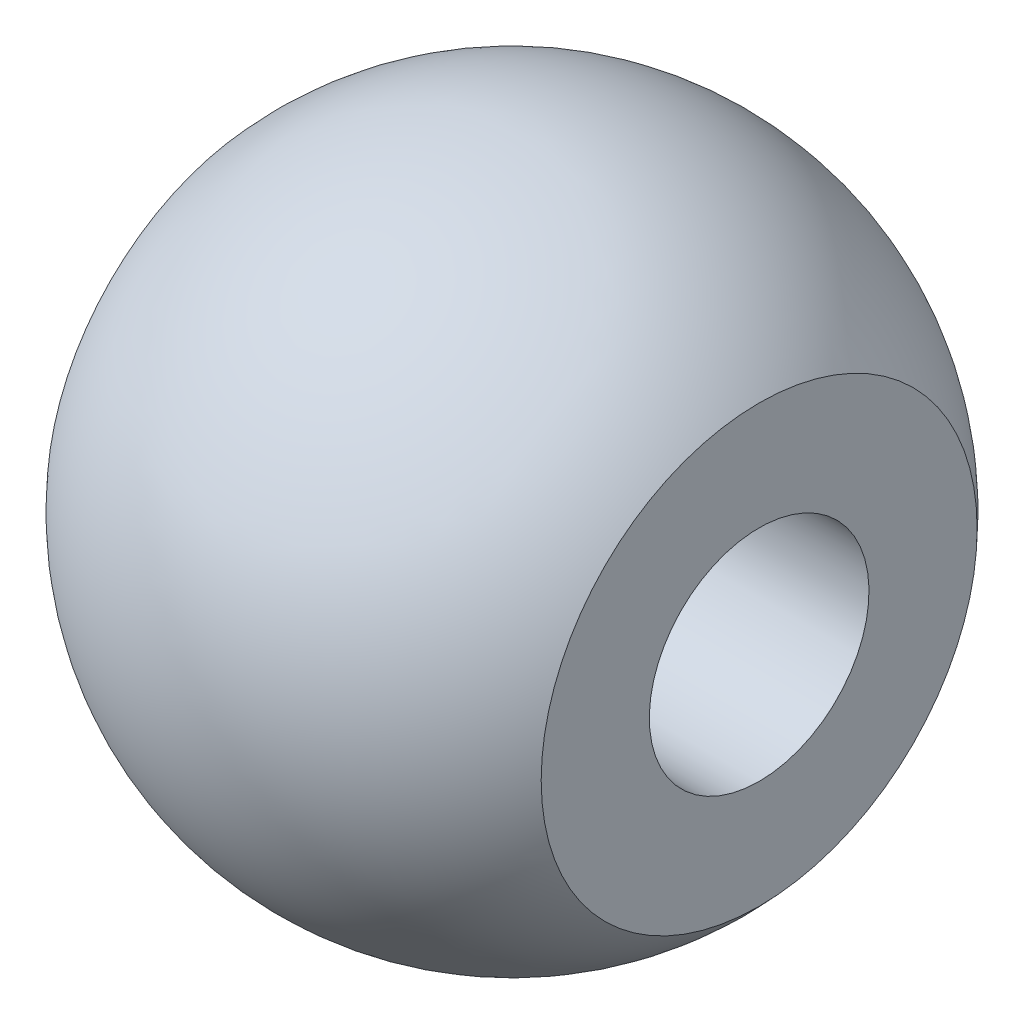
ISO-10303-21;
HEADER;
FILE_DESCRIPTION(('STEP AP214'),'2;1');
FILE_NAME('part.step','',(''),(''),'','','');
FILE_SCHEMA(('AUTOMOTIVE_DESIGN { 1 0 10303 214 1 1 1 1 }'));
ENDSEC;
DATA;
#1=APPLICATION_CONTEXT('core data for automotive mechanical design processes');
#2=APPLICATION_PROTOCOL_DEFINITION('international standard','automotive_design',2000,#1);
#3=PRODUCT_CONTEXT('',#1,'mechanical');
#4=PRODUCT('Part','Part','',(#3));
#5=PRODUCT_RELATED_PRODUCT_CATEGORY('part','',(#4));
#6=PRODUCT_DEFINITION_FORMATION('','',#4);
#7=PRODUCT_DEFINITION_CONTEXT('part definition',#1,'design');
#8=PRODUCT_DEFINITION('design','',#6,#7);
#9=PRODUCT_DEFINITION_SHAPE('','',#8);
#10=(LENGTH_UNIT() NAMED_UNIT(*) SI_UNIT(.MILLI.,.METRE.));
#11=(NAMED_UNIT(*) PLANE_ANGLE_UNIT() SI_UNIT($,.RADIAN.));
#12=(NAMED_UNIT(*) SI_UNIT($,.STERADIAN.) SOLID_ANGLE_UNIT());
#13=UNCERTAINTY_MEASURE_WITH_UNIT(LENGTH_MEASURE(1.E-05),#10,'distance_accuracy_value','');
#14=(GEOMETRIC_REPRESENTATION_CONTEXT(3) GLOBAL_UNCERTAINTY_ASSIGNED_CONTEXT((#13)) GLOBAL_UNIT_ASSIGNED_CONTEXT((#10,
#11,#12)) REPRESENTATION_CONTEXT('',''));
#15=CARTESIAN_POINT('',(0.,0.,0.));
#16=DIRECTION('',(0.,0.,1.));
#17=DIRECTION('',(1.,0.,0.));
#18=AXIS2_PLACEMENT_3D('',#15,#16,#17);
#19=CARTESIAN_POINT('',(0.,0.,0.));
#20=DIRECTION('',(-1.,0.,0.));
#21=DIRECTION('',(0.,1.,0.));
#22=AXIS2_PLACEMENT_3D('',#19,#20,#21);
#23=SPHERICAL_SURFACE('',#22,6.);
#24=CARTESIAN_POINT('',(-4.5,0.,0.));
#25=DIRECTION('',(-1.,0.,0.));
#26=DIRECTION('',(0.,-1.,0.));
#27=AXIS2_PLACEMENT_3D('',#24,#25,#26);
#28=CIRCLE('',#27,3.96862696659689);
#29=CARTESIAN_POINT('',(-4.5,3.96862696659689,0.));
#30=VERTEX_POINT('',#29);
#31=EDGE_CURVE('E10',#30,#30,#28,.T.);
#32=CARTESIAN_POINT('',(4.5,0.,0.));
#33=DIRECTION('',(-1.,0.,0.));
#34=DIRECTION('',(0.,-1.,0.));
#35=AXIS2_PLACEMENT_3D('',#32,#33,#34);
#36=CIRCLE('',#35,3.96862696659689);
#37=CARTESIAN_POINT('',(4.5,3.96862696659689,0.));
#38=VERTEX_POINT('',#37);
#39=EDGE_CURVE('E44',#38,#38,#36,.T.);
#40=CARTESIAN_POINT('',(-4.5,3.96862696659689,0.));
#41=CARTESIAN_POINT('',(-4.42988448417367,4.04813476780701,0.));
#42=CARTESIAN_POINT('',(-4.35765791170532,4.12578044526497,0.));
#43=CARTESIAN_POINT('',(-4.20919440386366,4.27713817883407,0.));
#44=CARTESIAN_POINT('',(-4.13295746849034,4.35085023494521,0.));
#45=CARTESIAN_POINT('',(-3.97668498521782,4.4941313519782,0.));
#46=CARTESIAN_POINT('',(-3.89664943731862,4.56370041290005,0.));
#47=CARTESIAN_POINT('',(-3.73300516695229,4.69850076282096,0.));
#48=CARTESIAN_POINT('',(-3.64939644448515,4.76373205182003,0.));
#49=CARTESIAN_POINT('',(-3.47884049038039,4.8896734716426,0.));
#50=CARTESIAN_POINT('',(-3.39189325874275,4.9503836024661,0.));
#51=CARTESIAN_POINT('',(-3.21490454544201,5.06711223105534,0.));
#52=CARTESIAN_POINT('',(-3.1248630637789,5.12313072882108,0.));
#53=CARTESIAN_POINT('',(-2.94193874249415,5.23031873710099,0.));
#54=CARTESIAN_POINT('',(-2.84905590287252,5.28148824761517,0.));
#55=CARTESIAN_POINT('',(-2.66070975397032,5.37883456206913,0.));
#56=CARTESIAN_POINT('',(-2.56524644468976,5.42501136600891,0.));
#57=CARTESIAN_POINT('',(-2.37200748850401,5.51224256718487,0.));
#58=CARTESIAN_POINT('',(-2.27423184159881,5.55329696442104,0.));
#59=CARTESIAN_POINT('',(-2.07664283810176,5.63016804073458,0.));
#60=CARTESIAN_POINT('',(-1.9768294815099,5.66598471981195,0.));
#61=CARTESIAN_POINT('',(-1.77544540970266,5.73227975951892,0.));
#62=CARTESIAN_POINT('',(-1.67387469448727,5.76275812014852,0.));
#63=CARTESIAN_POINT('',(-1.46926119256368,5.81829091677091,0.));
#64=CARTESIAN_POINT('',(-1.36621840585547,5.8433453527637,0.));
#65=CARTESIAN_POINT('',(-1.15895018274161,5.8879599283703,0.));
#66=CARTESIAN_POINT('',(-1.05472474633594,5.90752006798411,0.));
#67=CARTESIAN_POINT('',(-0.845383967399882,5.94109111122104,0.));
#68=CARTESIAN_POINT('',(-0.740268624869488,5.95510201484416,0.));
#69=CARTESIAN_POINT('',(-0.529443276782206,5.97753523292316,0.));
#70=CARTESIAN_POINT('',(-0.423733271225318,5.98595754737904,0.));
#71=CARTESIAN_POINT('',(-0.21201551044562,5.99718993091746,0.));
#72=CARTESIAN_POINT('',(-0.10600775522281,6.,0.));
#73=CARTESIAN_POINT('',(0.106007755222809,6.,0.));
#74=CARTESIAN_POINT('',(0.212015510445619,5.99718993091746,0.));
#75=CARTESIAN_POINT('',(0.423733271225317,5.98595754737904,0.));
#76=CARTESIAN_POINT('',(0.529443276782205,5.97753523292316,0.));
#77=CARTESIAN_POINT('',(0.740268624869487,5.95510201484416,0.));
#78=CARTESIAN_POINT('',(0.845383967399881,5.94109111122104,0.));
#79=CARTESIAN_POINT('',(1.05472474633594,5.90752006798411,0.));
#80=CARTESIAN_POINT('',(1.15895018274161,5.8879599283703,0.));
#81=CARTESIAN_POINT('',(1.36621840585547,5.8433453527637,0.));
#82=CARTESIAN_POINT('',(1.46926119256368,5.81829091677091,0.));
#83=CARTESIAN_POINT('',(1.67387469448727,5.76275812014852,0.));
#84=CARTESIAN_POINT('',(1.77544540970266,5.73227975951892,0.));
#85=CARTESIAN_POINT('',(1.9768294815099,5.66598471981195,0.));
#86=CARTESIAN_POINT('',(2.07664283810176,5.63016804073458,0.));
#87=CARTESIAN_POINT('',(2.27423184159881,5.55329696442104,0.));
#88=CARTESIAN_POINT('',(2.37200748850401,5.51224256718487,0.));
#89=CARTESIAN_POINT('',(2.56524644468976,5.42501136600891,0.));
#90=CARTESIAN_POINT('',(2.66070975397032,5.37883456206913,0.));
#91=CARTESIAN_POINT('',(2.84905590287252,5.28148824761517,0.));
#92=CARTESIAN_POINT('',(2.94193874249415,5.23031873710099,0.));
#93=CARTESIAN_POINT('',(3.1248630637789,5.12313072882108,0.));
#94=CARTESIAN_POINT('',(3.21490454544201,5.06711223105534,0.));
#95=CARTESIAN_POINT('',(3.39189325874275,4.9503836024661,0.));
#96=CARTESIAN_POINT('',(3.47884049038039,4.8896734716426,0.));
#97=CARTESIAN_POINT('',(3.64939644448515,4.76373205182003,0.));
#98=CARTESIAN_POINT('',(3.73300516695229,4.69850076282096,0.));
#99=CARTESIAN_POINT('',(3.89664943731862,4.56370041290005,0.));
#100=CARTESIAN_POINT('',(3.97668498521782,4.4941313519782,0.));
#101=CARTESIAN_POINT('',(4.13295746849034,4.35085023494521,0.));
#102=CARTESIAN_POINT('',(4.20919440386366,4.27713817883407,0.));
#103=CARTESIAN_POINT('',(4.35765791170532,4.12578044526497,0.));
#104=CARTESIAN_POINT('',(4.42988448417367,4.04813476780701,0.));
#105=CARTESIAN_POINT('',(4.5,3.96862696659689,0.));
#106=B_SPLINE_CURVE_WITH_KNOTS('',3,(#40,#41,#42,#43,#44,#45,#46,#47,#48,#49,#50,#51,#52,#53,
#54,#55,#56,#57,#58,#59,#60,#61,#62,#63,#64,#65,#66,#67,#68,#69,#70,#71,#72,#73,#74,#75,#76,#77,
#78,#79,#80,#81,#82,#83,#84,#85,#86,#87,#88,#89,#90,#91,#92,#93,#94,#95,#96,#97,#98,#99,#100,
#101,#102,#103,#104,#105),.UNSPECIFIED.,.F.,.F.,(4,2,2,2,2,2,2,2,2,2,2,2,2,2,2,2,2,2,2,2,2,2,2,
2,2,2,2,2,2,2,2,2,4),(0.,0.317986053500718,0.635972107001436,0.953958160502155,1.27194421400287,
1.58993026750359,1.90791632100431,2.22590237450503,2.54388842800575,2.86187448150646,
3.17986053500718,3.4978465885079,3.81583264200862,4.13381869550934,4.45180474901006,
4.76979080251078,5.08777685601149,5.40576290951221,5.72374896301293,6.04173501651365,
6.35972107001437,6.67770712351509,6.9956931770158,7.31367923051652,7.63166528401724,
7.94965133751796,8.26763739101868,8.5856234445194,8.90360949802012,9.22159555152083,
9.53958160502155,9.85756765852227,10.175553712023),.UNSPECIFIED.);
#107=EDGE_CURVE('BSEAM30',#30,#38,#106,.T.);
#108=ORIENTED_EDGE('',*,*,#31,.F.);
#109=ORIENTED_EDGE('',*,*,#39,.T.);
#110=ORIENTED_EDGE('',*,*,#107,.T.);
#111=ORIENTED_EDGE('',*,*,#107,.F.);
#112=EDGE_LOOP('',(#108,#110,#109,#111));
#113=FACE_BOUND('',#112,.T.);
#114=ADVANCED_FACE('F30',(#113),#23,.T.);
#115=CARTESIAN_POINT('',(-4.5,0.,0.));
#116=DIRECTION('',(-1.,0.,0.));
#117=DIRECTION('',(0.,-1.,0.));
#118=AXIS2_PLACEMENT_3D('',#115,#116,#117);
#119=CONICAL_SURFACE('',#118,3.96862696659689,1.10079445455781);
#120=CARTESIAN_POINT('',(-3.5,0.,0.));
#121=DIRECTION('',(-1.,0.,0.));
#122=DIRECTION('',(0.,-1.,0.));
#123=AXIS2_PLACEMENT_3D('',#120,#121,#122);
#124=CIRCLE('',#123,2.);
#125=CARTESIAN_POINT('',(-3.5,-2.,0.));
#126=VERTEX_POINT('',#125);
#127=EDGE_CURVE('E36',#126,#126,#124,.T.);
#128=ORIENTED_EDGE('',*,*,#127,.F.);
#129=EDGE_LOOP('',(#128));
#130=FACE_BOUND('',#129,.T.);
#131=ORIENTED_EDGE('',*,*,#31,.T.);
#132=EDGE_LOOP('',(#131));
#133=FACE_BOUND('',#132,.T.);
#134=ADVANCED_FACE('F59',(#130,#133),#119,.F.);
#135=CARTESIAN_POINT('',(-4.5,0.,0.));
#136=DIRECTION('',(-1.,0.,0.));
#137=DIRECTION('',(0.,-1.,0.));
#138=AXIS2_PLACEMENT_3D('',#135,#136,#137);
#139=CYLINDRICAL_SURFACE('',#138,2.);
#140=CARTESIAN_POINT('',(4.5,0.,0.));
#141=DIRECTION('',(-1.,0.,0.));
#142=DIRECTION('',(0.,-1.,0.));
#143=AXIS2_PLACEMENT_3D('',#140,#141,#142);
#144=CIRCLE('',#143,2.);
#145=CARTESIAN_POINT('',(4.5,-2.,0.));
#146=VERTEX_POINT('',#145);
#147=EDGE_CURVE('E40',#146,#146,#144,.T.);
#148=ORIENTED_EDGE('',*,*,#147,.F.);
#149=EDGE_LOOP('',(#148));
#150=FACE_BOUND('',#149,.T.);
#151=ORIENTED_EDGE('',*,*,#127,.T.);
#152=EDGE_LOOP('',(#151));
#153=FACE_BOUND('',#152,.T.);
#154=ADVANCED_FACE('F54',(#150,#153),#139,.F.);
#155=CARTESIAN_POINT('',(4.5,2.,0.));
#156=DIRECTION('',(-1.,0.,0.));
#157=DIRECTION('',(0.,-1.,0.));
#158=AXIS2_PLACEMENT_3D('',#155,#156,#157);
#159=PLANE('',#158);
#160=ORIENTED_EDGE('',*,*,#39,.F.);
#161=EDGE_LOOP('',(#160));
#162=FACE_BOUND('',#161,.T.);
#163=ORIENTED_EDGE('',*,*,#147,.T.);
#164=EDGE_LOOP('',(#163));
#165=FACE_BOUND('',#164,.T.);
#166=ADVANCED_FACE('F51',(#162,#165),#159,.F.);
#167=CLOSED_SHELL('',(#114,#134,#154,#166));
#168=MANIFOLD_SOLID_BREP('B2',#167);
#169=ADVANCED_BREP_SHAPE_REPRESENTATION('',(#18,#168),#14);
#170=SHAPE_DEFINITION_REPRESENTATION(#9,#169);
ENDSEC;
END-ISO-10303-21;
